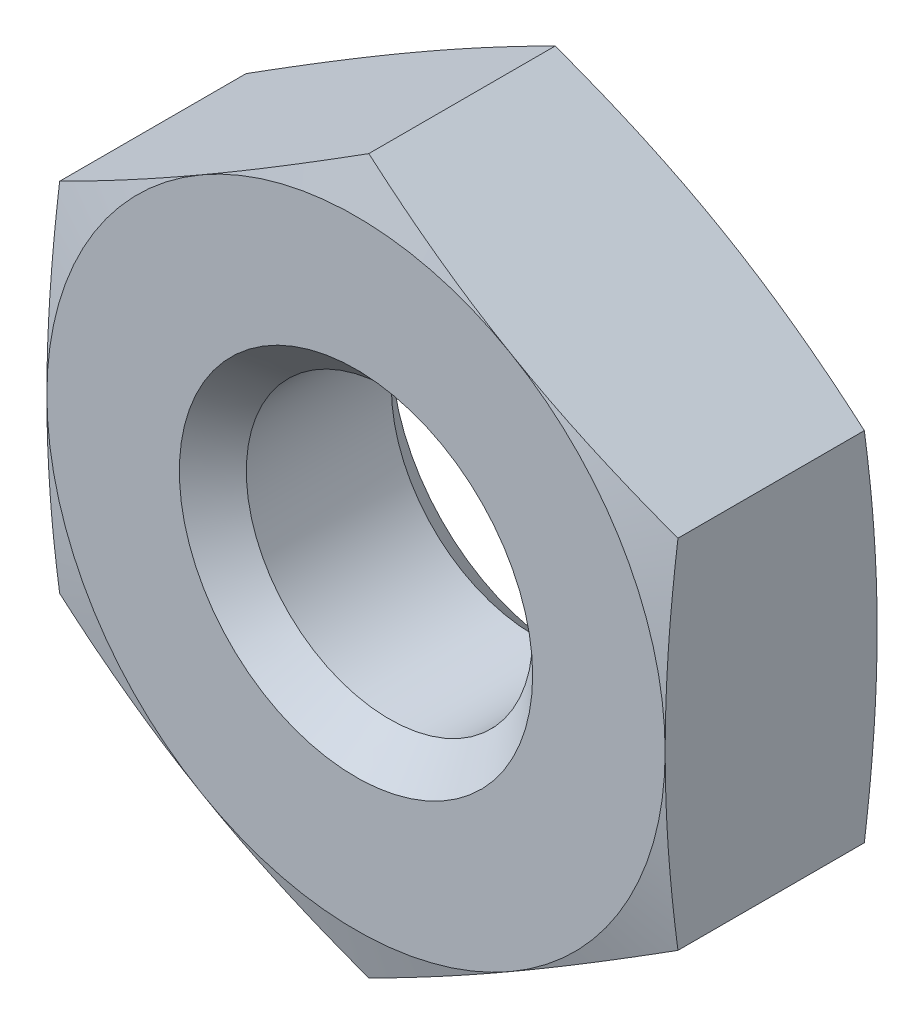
ISO-10303-21;
HEADER;
FILE_DESCRIPTION(('STEP AP214'),'2;1');
FILE_NAME('part.step','',(''),(''),'','','');
FILE_SCHEMA(('AUTOMOTIVE_DESIGN { 1 0 10303 214 1 1 1 1 }'));
ENDSEC;
DATA;
#1=APPLICATION_CONTEXT('core data for automotive mechanical design processes');
#2=APPLICATION_PROTOCOL_DEFINITION('international standard','automotive_design',2000,#1);
#3=PRODUCT_CONTEXT('',#1,'mechanical');
#4=PRODUCT('Part','Part','',(#3));
#5=PRODUCT_RELATED_PRODUCT_CATEGORY('part','',(#4));
#6=PRODUCT_DEFINITION_FORMATION('','',#4);
#7=PRODUCT_DEFINITION_CONTEXT('part definition',#1,'design');
#8=PRODUCT_DEFINITION('design','',#6,#7);
#9=PRODUCT_DEFINITION_SHAPE('','',#8);
#10=(LENGTH_UNIT() NAMED_UNIT(*) SI_UNIT(.MILLI.,.METRE.));
#11=(NAMED_UNIT(*) PLANE_ANGLE_UNIT() SI_UNIT($,.RADIAN.));
#12=(NAMED_UNIT(*) SI_UNIT($,.STERADIAN.) SOLID_ANGLE_UNIT());
#13=UNCERTAINTY_MEASURE_WITH_UNIT(LENGTH_MEASURE(1.E-05),#10,'distance_accuracy_value','');
#14=(GEOMETRIC_REPRESENTATION_CONTEXT(3) GLOBAL_UNCERTAINTY_ASSIGNED_CONTEXT((#13)) GLOBAL_UNIT_ASSIGNED_CONTEXT((#10,
#11,#12)) REPRESENTATION_CONTEXT('',''));
#15=CARTESIAN_POINT('',(0.,0.,0.));
#16=DIRECTION('',(0.,0.,1.));
#17=DIRECTION('',(1.,0.,0.));
#18=AXIS2_PLACEMENT_3D('',#15,#16,#17);
#19=CARTESIAN_POINT('',(0.,2.,-2.4));
#20=DIRECTION('',(0.,0.,1.));
#21=DIRECTION('',(1.,0.,0.));
#22=AXIS2_PLACEMENT_3D('',#19,#20,#21);
#23=PLANE('',#22);
#24=CARTESIAN_POINT('',(0.,0.,-2.40000000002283));
#25=DIRECTION('',(0.,0.,-1.));
#26=DIRECTION('',(-1.,0.,0.));
#27=AXIS2_PLACEMENT_3D('',#24,#25,#26);
#28=CIRCLE('',#27,1.99999999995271);
#29=CARTESIAN_POINT('',(-1.99999999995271,0.,-2.40000000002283));
#30=VERTEX_POINT('',#29);
#31=EDGE_CURVE('E20',#30,#30,#28,.F.);
#32=ORIENTED_EDGE('',*,*,#31,.T.);
#33=EDGE_LOOP('',(#32));
#34=FACE_BOUND('',#33,.T.);
#35=CARTESIAN_POINT('',(0.,0.,-2.39999999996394));
#36=DIRECTION('',(0.,0.,1.));
#37=DIRECTION('',(1.,0.,0.));
#38=AXIS2_PLACEMENT_3D('',#35,#36,#37);
#39=CIRCLE('',#38,3.50000000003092);
#40=CARTESIAN_POINT('',(1.75000000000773,-3.03108891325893,-2.39999999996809));
#41=VERTEX_POINT('',#40);
#42=CARTESIAN_POINT('',(3.50000000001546,0.,-2.39999999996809));
#43=VERTEX_POINT('',#42);
#44=EDGE_CURVE('E128',#41,#43,#39,.T.);
#45=ORIENTED_EDGE('',*,*,#44,.F.);
#46=CARTESIAN_POINT('',(0.,0.,-2.39999999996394));
#47=DIRECTION('',(0.,0.,1.));
#48=DIRECTION('',(1.,0.,0.));
#49=AXIS2_PLACEMENT_3D('',#46,#47,#48);
#50=CIRCLE('',#49,3.50000000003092);
#51=CARTESIAN_POINT('',(-1.75000000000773,-3.03108891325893,-2.39999999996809));
#52=VERTEX_POINT('',#51);
#53=EDGE_CURVE('E110',#52,#41,#50,.T.);
#54=ORIENTED_EDGE('',*,*,#53,.F.);
#55=CARTESIAN_POINT('',(0.,0.,-2.39999999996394));
#56=DIRECTION('',(0.,0.,1.));
#57=DIRECTION('',(1.,0.,0.));
#58=AXIS2_PLACEMENT_3D('',#55,#56,#57);
#59=CIRCLE('',#58,3.50000000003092);
#60=CARTESIAN_POINT('',(-3.50000000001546,0.,-2.39999999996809));
#61=VERTEX_POINT('',#60);
#62=EDGE_CURVE('E103',#61,#52,#59,.T.);
#63=ORIENTED_EDGE('',*,*,#62,.F.);
#64=CARTESIAN_POINT('',(0.,0.,-2.39999999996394));
#65=DIRECTION('',(0.,0.,1.));
#66=DIRECTION('',(1.,0.,0.));
#67=AXIS2_PLACEMENT_3D('',#64,#65,#66);
#68=CIRCLE('',#67,3.50000000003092);
#69=CARTESIAN_POINT('',(-1.75000000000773,3.03108891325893,-2.39999999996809));
#70=VERTEX_POINT('',#69);
#71=EDGE_CURVE('E425',#70,#61,#68,.T.);
#72=ORIENTED_EDGE('',*,*,#71,.F.);
#73=CARTESIAN_POINT('',(0.,0.,-2.39999999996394));
#74=DIRECTION('',(0.,0.,1.));
#75=DIRECTION('',(1.,0.,0.));
#76=AXIS2_PLACEMENT_3D('',#73,#74,#75);
#77=CIRCLE('',#76,3.50000000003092);
#78=CARTESIAN_POINT('',(1.75000000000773,3.03108891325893,-2.39999999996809));
#79=VERTEX_POINT('',#78);
#80=EDGE_CURVE('E135',#79,#70,#77,.T.);
#81=ORIENTED_EDGE('',*,*,#80,.F.);
#82=CARTESIAN_POINT('',(0.,0.,-2.39999999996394));
#83=DIRECTION('',(0.,0.,1.));
#84=DIRECTION('',(1.,0.,0.));
#85=AXIS2_PLACEMENT_3D('',#82,#83,#84);
#86=CIRCLE('',#85,3.50000000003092);
#87=EDGE_CURVE('E130',#43,#79,#86,.T.);
#88=ORIENTED_EDGE('',*,*,#87,.F.);
#89=EDGE_LOOP('',(#45,#54,#63,#72,#81,#88));
#90=FACE_BOUND('',#89,.T.);
#91=ADVANCED_FACE('F17',(#34,#90),#23,.F.);
#92=CARTESIAN_POINT('',(0.,0.,-2.39999999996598));
#93=DIRECTION('',(0.,0.,-1.));
#94=DIRECTION('',(-1.,0.,0.));
#95=AXIS2_PLACEMENT_3D('',#92,#93,#94);
#96=CONICAL_SURFACE('',#95,1.99999999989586,0.785398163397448);
#97=CARTESIAN_POINT('',(0.,0.,-2.021));
#98=DIRECTION('',(0.,0.,1.));
#99=DIRECTION('',(1.,0.,0.));
#100=AXIS2_PLACEMENT_3D('',#97,#98,#99);
#101=CIRCLE('',#100,1.621);
#102=CARTESIAN_POINT('',(1.621,0.,-2.021));
#103=VERTEX_POINT('',#102);
#104=EDGE_CURVE('E125',#103,#103,#101,.T.);
#105=ORIENTED_EDGE('',*,*,#104,.T.);
#106=EDGE_LOOP('',(#105));
#107=FACE_BOUND('',#106,.T.);
#108=ORIENTED_EDGE('',*,*,#31,.F.);
#109=EDGE_LOOP('',(#108));
#110=FACE_BOUND('',#109,.T.);
#111=ADVANCED_FACE('F307',(#107,#110),#96,.F.);
#112=CARTESIAN_POINT('',(0.,0.,-2.25404791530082));
#113=DIRECTION('',(0.,0.,1.));
#114=DIRECTION('',(1.,0.,0.));
#115=AXIS2_PLACEMENT_3D('',#112,#113,#114);
#116=CONICAL_SURFACE('',#115,4.04470059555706,1.30899693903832);
#117=CARTESIAN_POINT('',(-1.75,-3.03108891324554,-2.39999999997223));
#118=CARTESIAN_POINT('',(-1.67678656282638,-3.07335871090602,-2.40000384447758));
#119=CARTESIAN_POINT('',(-1.60357518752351,-3.11562731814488,-2.39917891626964));
#120=CARTESIAN_POINT('',(-1.45718196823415,-3.20014748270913,-2.39590404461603));
#121=CARTESIAN_POINT('',(-1.38400012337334,-3.24239904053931,-2.39345415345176));
#122=CARTESIAN_POINT('',(-1.16470054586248,-3.36901171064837,-2.38372331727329));
#123=CARTESIAN_POINT('',(-1.0186579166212,-3.45332946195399,-2.37406106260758));
#124=CARTESIAN_POINT('',(-0.726992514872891,-3.62172256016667,-2.34897707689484));
#125=CARTESIAN_POINT('',(-0.581369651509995,-3.70579795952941,-2.33355670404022));
#126=CARTESIAN_POINT('',(-0.290410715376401,-3.87378317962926,-2.29775556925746));
#127=CARTESIAN_POINT('',(-0.145075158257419,-3.95769270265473,-2.27736917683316));
#128=CARTESIAN_POINT('',(-3.5042136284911E-13,-4.04145188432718,-2.25491840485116));
#129=B_SPLINE_CURVE_WITH_KNOTS('',3,(#117,#118,#119,#120,#121,#122,#123,#124,#125,#126,#127,
#128),.UNSPECIFIED.,.F.,.F.,(4,2,2,2,2,4),(0.,0.253610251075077,0.507212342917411,
1.01382506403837,1.52031836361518,2.02738862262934),.UNSPECIFIED.);
#130=CARTESIAN_POINT('',(0.,-4.04145188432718,-2.25491840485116));
#131=VERTEX_POINT('',#130);
#132=EDGE_CURVE('E115',#52,#131,#129,.T.);
#133=ORIENTED_EDGE('',*,*,#132,.F.);
#134=ORIENTED_EDGE('',*,*,#53,.T.);
#135=CARTESIAN_POINT('',(3.49830599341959E-13,-4.04145188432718,-2.25491840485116));
#136=CARTESIAN_POINT('',(0.145075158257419,-3.95769270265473,-2.27736917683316));
#137=CARTESIAN_POINT('',(0.290410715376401,-3.87378317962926,-2.29775556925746));
#138=CARTESIAN_POINT('',(0.581369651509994,-3.70579795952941,-2.33355670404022));
#139=CARTESIAN_POINT('',(0.726992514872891,-3.62172256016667,-2.34897707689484));
#140=CARTESIAN_POINT('',(1.0186579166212,-3.45332946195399,-2.37406106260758));
#141=CARTESIAN_POINT('',(1.16470054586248,-3.36901171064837,-2.38372331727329));
#142=CARTESIAN_POINT('',(1.38400012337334,-3.24239904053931,-2.39345415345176));
#143=CARTESIAN_POINT('',(1.45718196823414,-3.20014748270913,-2.39590404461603));
#144=CARTESIAN_POINT('',(1.60357518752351,-3.11562731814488,-2.39917891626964));
#145=CARTESIAN_POINT('',(1.67678656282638,-3.07335871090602,-2.40000384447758));
#146=CARTESIAN_POINT('',(1.75,-3.03108891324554,-2.39999999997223));
#147=B_SPLINE_CURVE_WITH_KNOTS('',3,(#135,#136,#137,#138,#139,#140,#141,#142,#143,#144,#145,
#146),.UNSPECIFIED.,.F.,.F.,(4,2,2,2,2,4),(0.,0.507070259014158,1.01356355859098,
1.52017627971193,1.77377837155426,2.02738862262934),.UNSPECIFIED.);
#148=EDGE_CURVE('E113',#131,#41,#147,.T.);
#149=ORIENTED_EDGE('',*,*,#148,.F.);
#150=EDGE_LOOP('',(#133,#134,#149));
#151=FACE_BOUND('',#150,.T.);
#152=ADVANCED_FACE('F112',(#151),#116,.T.);
#153=CARTESIAN_POINT('',(0.,0.,-2.25404791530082));
#154=DIRECTION('',(0.,0.,1.));
#155=DIRECTION('',(1.,0.,0.));
#156=AXIS2_PLACEMENT_3D('',#153,#154,#155);
#157=CONICAL_SURFACE('',#156,4.04470059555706,1.30899693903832);
#158=CARTESIAN_POINT('',(-3.5,0.,-2.39999999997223));
#159=CARTESIAN_POINT('',(-3.5,-0.0845395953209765,-2.40000384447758));
#160=CARTESIAN_POINT('',(-3.5,-0.169076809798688,-2.39917891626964));
#161=CARTESIAN_POINT('',(-3.5,-0.338117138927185,-2.39590404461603));
#162=CARTESIAN_POINT('',(-3.5,-0.422620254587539,-2.39345415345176));
#163=CARTESIAN_POINT('',(-3.5,-0.675845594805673,-2.38372331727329));
#164=CARTESIAN_POINT('',(-3.5,-0.8444810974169,-2.37406106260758));
#165=CARTESIAN_POINT('',(-3.5,-1.18126729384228,-2.34897707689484));
#166=CARTESIAN_POINT('',(-3.5,-1.34941809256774,-2.33355670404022));
#167=CARTESIAN_POINT('',(-3.5,-1.68538853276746,-2.29775556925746));
#168=CARTESIAN_POINT('',(-3.5,-1.85320757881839,-2.27736917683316));
#169=CARTESIAN_POINT('',(-3.5,-2.02072594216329,-2.25491840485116));
#170=B_SPLINE_CURVE_WITH_KNOTS('',3,(#158,#159,#160,#161,#162,#163,#164,#165,#166,#167,#168,
#169),.UNSPECIFIED.,.F.,.F.,(4,2,2,2,2,4),(0.,0.253610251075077,0.507212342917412,
1.01382506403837,1.52031836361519,2.02738862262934),.UNSPECIFIED.);
#171=CARTESIAN_POINT('',(-3.49999999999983,-2.02072594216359,-2.25491840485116));
#172=VERTEX_POINT('',#171);
#173=EDGE_CURVE('E296',#61,#172,#170,.T.);
#174=ORIENTED_EDGE('',*,*,#173,.F.);
#175=ORIENTED_EDGE('',*,*,#62,.T.);
#176=CARTESIAN_POINT('',(-3.49999999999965,-2.02072594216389,-2.25491840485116));
#177=CARTESIAN_POINT('',(-3.35492484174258,-2.10448512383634,-2.27736917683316));
#178=CARTESIAN_POINT('',(-3.2095892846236,-2.18839464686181,-2.29775556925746));
#179=CARTESIAN_POINT('',(-2.91863034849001,-2.35637986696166,-2.33355670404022));
#180=CARTESIAN_POINT('',(-2.77300748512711,-2.4404552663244,-2.34897707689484));
#181=CARTESIAN_POINT('',(-2.4813420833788,-2.60884836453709,-2.37406106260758));
#182=CARTESIAN_POINT('',(-2.33529945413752,-2.6931661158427,-2.38372331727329));
#183=CARTESIAN_POINT('',(-2.11599987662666,-2.81977878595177,-2.39345415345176));
#184=CARTESIAN_POINT('',(-2.04281803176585,-2.86203034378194,-2.39590404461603));
#185=CARTESIAN_POINT('',(-1.89642481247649,-2.94655050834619,-2.39917891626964));
#186=CARTESIAN_POINT('',(-1.82321343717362,-2.98881911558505,-2.40000384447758));
#187=CARTESIAN_POINT('',(-1.75,-3.03108891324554,-2.39999999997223));
#188=B_SPLINE_CURVE_WITH_KNOTS('',3,(#176,#177,#178,#179,#180,#181,#182,#183,#184,#185,#186,
#187),.UNSPECIFIED.,.F.,.F.,(4,2,2,2,2,4),(0.,0.507070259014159,1.01356355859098,
1.52017627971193,1.77377837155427,2.02738862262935),.UNSPECIFIED.);
#189=EDGE_CURVE('E139',#172,#52,#188,.T.);
#190=ORIENTED_EDGE('',*,*,#189,.F.);
#191=EDGE_LOOP('',(#174,#175,#190));
#192=FACE_BOUND('',#191,.T.);
#193=ADVANCED_FACE('F286',(#192),#157,.T.);
#194=CARTESIAN_POINT('',(0.,0.,-2.25404791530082));
#195=DIRECTION('',(0.,0.,1.));
#196=DIRECTION('',(1.,0.,0.));
#197=AXIS2_PLACEMENT_3D('',#194,#195,#196);
#198=CONICAL_SURFACE('',#197,4.04470059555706,1.30899693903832);
#199=ORIENTED_EDGE('',*,*,#71,.T.);
#200=CARTESIAN_POINT('',(-3.5,2.02072594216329,-2.25491840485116));
#201=CARTESIAN_POINT('',(-3.5,1.85320757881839,-2.27736917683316));
#202=CARTESIAN_POINT('',(-3.5,1.68538853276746,-2.29775556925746));
#203=CARTESIAN_POINT('',(-3.5,1.34941809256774,-2.33355670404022));
#204=CARTESIAN_POINT('',(-3.5,1.18126729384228,-2.34897707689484));
#205=CARTESIAN_POINT('',(-3.5,0.844481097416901,-2.37406106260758));
#206=CARTESIAN_POINT('',(-3.5,0.675845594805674,-2.38372331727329));
#207=CARTESIAN_POINT('',(-3.5,0.42262025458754,-2.39345415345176));
#208=CARTESIAN_POINT('',(-3.5,0.338117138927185,-2.39590404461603));
#209=CARTESIAN_POINT('',(-3.5,0.169076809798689,-2.39917891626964));
#210=CARTESIAN_POINT('',(-3.5,0.0845395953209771,-2.40000384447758));
#211=CARTESIAN_POINT('',(-3.5,0.,-2.39999999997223));
#212=B_SPLINE_CURVE_WITH_KNOTS('',3,(#200,#201,#202,#203,#204,#205,#206,#207,#208,#209,#210,
#211),.UNSPECIFIED.,.F.,.F.,(4,2,2,2,2,4),(0.,0.507070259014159,1.01356355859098,
1.52017627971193,1.77377837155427,2.02738862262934),.UNSPECIFIED.);
#213=CARTESIAN_POINT('',(-3.49999999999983,2.02072594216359,-2.25491840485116));
#214=VERTEX_POINT('',#213);
#215=EDGE_CURVE('E291',#214,#61,#212,.T.);
#216=ORIENTED_EDGE('',*,*,#215,.F.);
#217=CARTESIAN_POINT('',(-1.75,3.03108891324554,-2.39999999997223));
#218=CARTESIAN_POINT('',(-1.82321343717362,2.98881911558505,-2.40000384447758));
#219=CARTESIAN_POINT('',(-1.89642481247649,2.94655050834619,-2.39917891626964));
#220=CARTESIAN_POINT('',(-2.04281803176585,2.86203034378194,-2.39590404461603));
#221=CARTESIAN_POINT('',(-2.11599987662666,2.81977878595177,-2.39345415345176));
#222=CARTESIAN_POINT('',(-2.33529945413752,2.6931661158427,-2.38372331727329));
#223=CARTESIAN_POINT('',(-2.4813420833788,2.60884836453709,-2.37406106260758));
#224=CARTESIAN_POINT('',(-2.77300748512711,2.4404552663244,-2.34897707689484));
#225=CARTESIAN_POINT('',(-2.91863034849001,2.35637986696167,-2.33355670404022));
#226=CARTESIAN_POINT('',(-3.2095892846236,2.18839464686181,-2.29775556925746));
#227=CARTESIAN_POINT('',(-3.35492484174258,2.10448512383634,-2.27736917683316));
#228=CARTESIAN_POINT('',(-3.49999999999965,2.02072594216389,-2.25491840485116));
#229=B_SPLINE_CURVE_WITH_KNOTS('',3,(#217,#218,#219,#220,#221,#222,#223,#224,#225,#226,#227,
#228),.UNSPECIFIED.,.F.,.F.,(4,2,2,2,2,4),(0.,0.253610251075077,0.507212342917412,
1.01382506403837,1.52031836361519,2.02738862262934),.UNSPECIFIED.);
#230=EDGE_CURVE('E269',#70,#214,#229,.T.);
#231=ORIENTED_EDGE('',*,*,#230,.F.);
#232=EDGE_LOOP('',(#199,#216,#231));
#233=FACE_BOUND('',#232,.T.);
#234=ADVANCED_FACE('F283',(#233),#198,.T.);
#235=CARTESIAN_POINT('',(0.,0.,-2.25404791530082));
#236=DIRECTION('',(0.,0.,1.));
#237=DIRECTION('',(1.,0.,0.));
#238=AXIS2_PLACEMENT_3D('',#235,#236,#237);
#239=CONICAL_SURFACE('',#238,4.04470059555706,1.30899693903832);
#240=ORIENTED_EDGE('',*,*,#80,.T.);
#241=CARTESIAN_POINT('',(-3.49976461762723E-13,4.04145188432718,-2.25491840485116));
#242=CARTESIAN_POINT('',(-0.145075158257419,3.95769270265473,-2.27736917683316));
#243=CARTESIAN_POINT('',(-0.290410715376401,3.87378317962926,-2.29775556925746));
#244=CARTESIAN_POINT('',(-0.581369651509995,3.70579795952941,-2.33355670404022));
#245=CARTESIAN_POINT('',(-0.726992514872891,3.62172256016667,-2.34897707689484));
#246=CARTESIAN_POINT('',(-1.0186579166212,3.45332946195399,-2.37406106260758));
#247=CARTESIAN_POINT('',(-1.16470054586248,3.36901171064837,-2.38372331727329));
#248=CARTESIAN_POINT('',(-1.38400012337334,3.24239904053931,-2.39345415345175));
#249=CARTESIAN_POINT('',(-1.45718196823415,3.20014748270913,-2.39590404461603));
#250=CARTESIAN_POINT('',(-1.60357518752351,3.11562731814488,-2.39917891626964));
#251=CARTESIAN_POINT('',(-1.67678656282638,3.07335871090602,-2.40000384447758));
#252=CARTESIAN_POINT('',(-1.75,3.03108891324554,-2.39999999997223));
#253=B_SPLINE_CURVE_WITH_KNOTS('',3,(#241,#242,#243,#244,#245,#246,#247,#248,#249,#250,#251,
#252),.UNSPECIFIED.,.F.,.F.,(4,2,2,2,2,4),(0.,0.507070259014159,1.01356355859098,
1.52017627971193,1.77377837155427,2.02738862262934),.UNSPECIFIED.);
#254=CARTESIAN_POINT('',(0.,4.04145188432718,-2.25491840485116));
#255=VERTEX_POINT('',#254);
#256=EDGE_CURVE('E274',#255,#70,#253,.T.);
#257=ORIENTED_EDGE('',*,*,#256,.F.);
#258=CARTESIAN_POINT('',(1.75,3.03108891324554,-2.39999999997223));
#259=CARTESIAN_POINT('',(1.67678656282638,3.07335871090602,-2.40000384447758));
#260=CARTESIAN_POINT('',(1.60357518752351,3.11562731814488,-2.39917891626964));
#261=CARTESIAN_POINT('',(1.45718196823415,3.20014748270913,-2.39590404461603));
#262=CARTESIAN_POINT('',(1.38400012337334,3.24239904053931,-2.39345415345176));
#263=CARTESIAN_POINT('',(1.16470054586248,3.36901171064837,-2.38372331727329));
#264=CARTESIAN_POINT('',(1.0186579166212,3.45332946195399,-2.37406106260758));
#265=CARTESIAN_POINT('',(0.726992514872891,3.62172256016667,-2.34897707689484));
#266=CARTESIAN_POINT('',(0.581369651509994,3.70579795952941,-2.33355670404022));
#267=CARTESIAN_POINT('',(0.290410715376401,3.87378317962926,-2.29775556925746));
#268=CARTESIAN_POINT('',(0.145075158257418,3.95769270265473,-2.27736917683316));
#269=CARTESIAN_POINT('',(3.49543170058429E-13,4.04145188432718,-2.25491840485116));
#270=B_SPLINE_CURVE_WITH_KNOTS('',3,(#258,#259,#260,#261,#262,#263,#264,#265,#266,#267,#268,
#269),.UNSPECIFIED.,.F.,.F.,(4,2,2,2,2,4),(0.,0.253610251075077,0.507212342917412,
1.01382506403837,1.52031836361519,2.02738862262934),.UNSPECIFIED.);
#271=EDGE_CURVE('E183',#79,#255,#270,.T.);
#272=ORIENTED_EDGE('',*,*,#271,.F.);
#273=EDGE_LOOP('',(#240,#257,#272));
#274=FACE_BOUND('',#273,.T.);
#275=ADVANCED_FACE('F165',(#274),#239,.T.);
#276=CARTESIAN_POINT('',(0.,0.,-2.25404791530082));
#277=DIRECTION('',(0.,0.,1.));
#278=DIRECTION('',(1.,0.,0.));
#279=AXIS2_PLACEMENT_3D('',#276,#277,#278);
#280=CONICAL_SURFACE('',#279,4.04470059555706,1.30899693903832);
#281=CARTESIAN_POINT('',(1.75,-3.03108891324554,-2.39999999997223));
#282=CARTESIAN_POINT('',(1.82321343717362,-2.98881911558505,-2.40000384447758));
#283=CARTESIAN_POINT('',(1.89642481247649,-2.94655050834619,-2.39917891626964));
#284=CARTESIAN_POINT('',(2.04281803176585,-2.86203034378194,-2.39590404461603));
#285=CARTESIAN_POINT('',(2.11599987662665,-2.81977878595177,-2.39345415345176));
#286=CARTESIAN_POINT('',(2.33529945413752,-2.6931661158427,-2.38372331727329));
#287=CARTESIAN_POINT('',(2.4813420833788,-2.60884836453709,-2.37406106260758));
#288=CARTESIAN_POINT('',(2.77300748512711,-2.4404552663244,-2.34897707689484));
#289=CARTESIAN_POINT('',(2.91863034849,-2.35637986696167,-2.33355670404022));
#290=CARTESIAN_POINT('',(3.2095892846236,-2.18839464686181,-2.29775556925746));
#291=CARTESIAN_POINT('',(3.35492484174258,-2.10448512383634,-2.27736917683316));
#292=CARTESIAN_POINT('',(3.49999999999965,-2.02072594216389,-2.25491840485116));
#293=B_SPLINE_CURVE_WITH_KNOTS('',3,(#281,#282,#283,#284,#285,#286,#287,#288,#289,#290,#291,
#292),.UNSPECIFIED.,.F.,.F.,(4,2,2,2,2,4),(0.,0.253610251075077,0.507212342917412,
1.01382506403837,1.52031836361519,2.02738862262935),.UNSPECIFIED.);
#294=CARTESIAN_POINT('',(3.49999999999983,-2.02072594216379,-2.25491840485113));
#295=VERTEX_POINT('',#294);
#296=EDGE_CURVE('E121',#41,#295,#293,.T.);
#297=ORIENTED_EDGE('',*,*,#296,.F.);
#298=ORIENTED_EDGE('',*,*,#44,.T.);
#299=CARTESIAN_POINT('',(3.5,-2.02072594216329,-2.25491840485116));
#300=CARTESIAN_POINT('',(3.5,-1.8532075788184,-2.27736917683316));
#301=CARTESIAN_POINT('',(3.5,-1.68538853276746,-2.29775556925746));
#302=CARTESIAN_POINT('',(3.5,-1.34941809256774,-2.33355670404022));
#303=CARTESIAN_POINT('',(3.5,-1.18126729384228,-2.34897707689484));
#304=CARTESIAN_POINT('',(3.5,-0.844481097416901,-2.37406106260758));
#305=CARTESIAN_POINT('',(3.5,-0.675845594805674,-2.38372331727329));
#306=CARTESIAN_POINT('',(3.5,-0.42262025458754,-2.39345415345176));
#307=CARTESIAN_POINT('',(3.5,-0.338117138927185,-2.39590404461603));
#308=CARTESIAN_POINT('',(3.5,-0.169076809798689,-2.39917891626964));
#309=CARTESIAN_POINT('',(3.5,-0.084539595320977,-2.40000384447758));
#310=CARTESIAN_POINT('',(3.5,0.,-2.39999999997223));
#311=B_SPLINE_CURVE_WITH_KNOTS('',3,(#299,#300,#301,#302,#303,#304,#305,#306,#307,#308,#309,
#310),.UNSPECIFIED.,.F.,.F.,(4,2,2,2,2,4),(0.,0.507070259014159,1.01356355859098,
1.52017627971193,1.77377837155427,2.02738862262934),.UNSPECIFIED.);
#312=EDGE_CURVE('E138',#295,#43,#311,.T.);
#313=ORIENTED_EDGE('',*,*,#312,.F.);
#314=EDGE_LOOP('',(#297,#298,#313));
#315=FACE_BOUND('',#314,.T.);
#316=ADVANCED_FACE('F137',(#315),#280,.T.);
#317=CARTESIAN_POINT('',(0.,0.,-2.25404791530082));
#318=DIRECTION('',(0.,0.,1.));
#319=DIRECTION('',(1.,0.,0.));
#320=AXIS2_PLACEMENT_3D('',#317,#318,#319);
#321=CONICAL_SURFACE('',#320,4.04470059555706,1.30899693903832);
#322=ORIENTED_EDGE('',*,*,#87,.T.);
#323=CARTESIAN_POINT('',(3.49999999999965,2.02072594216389,-2.25491840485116));
#324=CARTESIAN_POINT('',(3.35492484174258,2.10448512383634,-2.27736917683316));
#325=CARTESIAN_POINT('',(3.2095892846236,2.18839464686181,-2.29775556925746));
#326=CARTESIAN_POINT('',(2.91863034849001,2.35637986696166,-2.33355670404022));
#327=CARTESIAN_POINT('',(2.77300748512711,2.4404552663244,-2.34897707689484));
#328=CARTESIAN_POINT('',(2.4813420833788,2.60884836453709,-2.37406106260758));
#329=CARTESIAN_POINT('',(2.33529945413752,2.6931661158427,-2.38372331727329));
#330=CARTESIAN_POINT('',(2.11599987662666,2.81977878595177,-2.39345415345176));
#331=CARTESIAN_POINT('',(2.04281803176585,2.86203034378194,-2.39590404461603));
#332=CARTESIAN_POINT('',(1.89642481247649,2.94655050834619,-2.39917891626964));
#333=CARTESIAN_POINT('',(1.82321343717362,2.98881911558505,-2.40000384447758));
#334=CARTESIAN_POINT('',(1.75,3.03108891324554,-2.39999999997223));
#335=B_SPLINE_CURVE_WITH_KNOTS('',3,(#323,#324,#325,#326,#327,#328,#329,#330,#331,#332,#333,
#334),.UNSPECIFIED.,.F.,.F.,(4,2,2,2,2,4),(0.,0.507070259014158,1.01356355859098,
1.52017627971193,1.77377837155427,2.02738862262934),.UNSPECIFIED.);
#336=CARTESIAN_POINT('',(3.49999999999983,2.02072594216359,-2.25491840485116));
#337=VERTEX_POINT('',#336);
#338=EDGE_CURVE('E275',#337,#79,#335,.T.);
#339=ORIENTED_EDGE('',*,*,#338,.F.);
#340=CARTESIAN_POINT('',(3.5,0.,-2.39999999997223));
#341=CARTESIAN_POINT('',(3.5,0.0845395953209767,-2.40000384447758));
#342=CARTESIAN_POINT('',(3.5,0.169076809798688,-2.39917891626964));
#343=CARTESIAN_POINT('',(3.5,0.338117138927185,-2.39590404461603));
#344=CARTESIAN_POINT('',(3.5,0.42262025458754,-2.39345415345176));
#345=CARTESIAN_POINT('',(3.5,0.675845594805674,-2.38372331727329));
#346=CARTESIAN_POINT('',(3.5,0.844481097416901,-2.37406106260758));
#347=CARTESIAN_POINT('',(3.5,1.18126729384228,-2.34897707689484));
#348=CARTESIAN_POINT('',(3.5,1.34941809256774,-2.33355670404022));
#349=CARTESIAN_POINT('',(3.5,1.68538853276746,-2.29775556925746));
#350=CARTESIAN_POINT('',(3.5,1.85320757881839,-2.27736917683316));
#351=CARTESIAN_POINT('',(3.5,2.02072594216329,-2.25491840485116));
#352=B_SPLINE_CURVE_WITH_KNOTS('',3,(#340,#341,#342,#343,#344,#345,#346,#347,#348,#349,#350,
#351),.UNSPECIFIED.,.F.,.F.,(4,2,2,2,2,4),(0.,0.253610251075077,0.507212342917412,
1.01382506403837,1.52031836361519,2.02738862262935),.UNSPECIFIED.);
#353=EDGE_CURVE('E177',#43,#337,#352,.T.);
#354=ORIENTED_EDGE('',*,*,#353,.F.);
#355=EDGE_LOOP('',(#322,#339,#354));
#356=FACE_BOUND('',#355,.T.);
#357=ADVANCED_FACE('F164',(#356),#321,.T.);
#358=CARTESIAN_POINT('',(0.,0.,-2.4));
#359=DIRECTION('',(0.,0.,1.));
#360=DIRECTION('',(1.,0.,0.));
#361=AXIS2_PLACEMENT_3D('',#358,#359,#360);
#362=CYLINDRICAL_SURFACE('',#361,1.621);
#363=ORIENTED_EDGE('',*,*,#104,.F.);
#364=EDGE_LOOP('',(#363));
#365=FACE_BOUND('',#364,.T.);
#366=CARTESIAN_POINT('',(0.,0.,-0.379000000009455));
#367=DIRECTION('',(0.,0.,1.));
#368=DIRECTION('',(1.,0.,0.));
#369=AXIS2_PLACEMENT_3D('',#366,#367,#368);
#370=CIRCLE('',#369,1.62100000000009);
#371=CARTESIAN_POINT('',(1.62100000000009,0.,-0.379000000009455));
#372=VERTEX_POINT('',#371);
#373=EDGE_CURVE('E347',#372,#372,#370,.T.);
#374=ORIENTED_EDGE('',*,*,#373,.T.);
#375=EDGE_LOOP('',(#374));
#376=FACE_BOUND('',#375,.T.);
#377=ADVANCED_FACE('F450',(#365,#376),#362,.F.);
#378=CARTESIAN_POINT('',(0.,-4.04145188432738,-3.4));
#379=DIRECTION('',(0.5,-0.866025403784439,0.));
#380=DIRECTION('',(0.866025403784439,0.5,0.));
#381=AXIS2_PLACEMENT_3D('',#378,#379,#380);
#382=PLANE('',#381);
#383=ORIENTED_EDGE('',*,*,#296,.T.);
#384=DIRECTION('',(0.,0.,-1.));
#385=VECTOR('',#384,1.);
#386=CARTESIAN_POINT('',(3.5,-2.02072594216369,-3.4));
#387=LINE('',#386,#385);
#388=CARTESIAN_POINT('',(3.50000001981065,-2.02072593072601,-0.14508159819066));
#389=VERTEX_POINT('',#388);
#390=EDGE_CURVE('E178',#389,#295,#387,.T.);
#391=ORIENTED_EDGE('',*,*,#390,.F.);
#392=CARTESIAN_POINT('',(1.75000000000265,-3.03108891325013,1.43933011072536E-11));
#393=CARTESIAN_POINT('',(1.8232134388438,-2.98881911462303,3.84451752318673E-06));
#394=CARTESIAN_POINT('',(1.89642481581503,-2.94655050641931,-0.000821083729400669));
#395=CARTESIAN_POINT('',(2.0428180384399,-2.86203033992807,-0.00409595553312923));
#396=CARTESIAN_POINT('',(2.11599988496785,-2.81977878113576,-0.00654584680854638));
#397=CARTESIAN_POINT('',(2.33529946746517,-2.69316610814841,-0.0162766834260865));
#398=CARTESIAN_POINT('',(2.48134210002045,-2.60884835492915,-0.0259389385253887));
#399=CARTESIAN_POINT('',(2.77300750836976,-2.44045525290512,-0.0510229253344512));
#400=CARTESIAN_POINT('',(2.91863037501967,-2.35637985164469,-0.0664432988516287));
#401=CARTESIAN_POINT('',(3.20958931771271,-2.18839462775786,-0.102244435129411));
#402=CARTESIAN_POINT('',(3.35492487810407,-2.10448510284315,-0.122630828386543));
#403=CARTESIAN_POINT('',(3.5000000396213,-2.02072591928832,-0.145081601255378));
#404=B_SPLINE_CURVE_WITH_KNOTS('',3,(#392,#393,#394,#395,#396,#397,#398,#399,#400,#401,#402,
#403),.UNSPECIFIED.,.F.,.F.,(4,2,2,2,2,4),(0.,0.253610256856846,0.507212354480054,
1.01382508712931,1.52031839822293,2.02738866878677),.UNSPECIFIED.);
#405=CARTESIAN_POINT('',(1.75000000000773,-3.03108891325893,6.1834054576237E-12));
#406=VERTEX_POINT('',#405);
#407=EDGE_CURVE('E409',#406,#389,#404,.T.);
#408=ORIENTED_EDGE('',*,*,#407,.F.);
#409=CARTESIAN_POINT('',(8.3690819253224E-08,-4.04145183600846,-0.145081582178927));
#410=CARTESIAN_POINT('',(0.145075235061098,-3.95769265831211,-0.122630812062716));
#411=CARTESIAN_POINT('',(0.290410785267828,-3.87378313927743,-0.102244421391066));
#412=CARTESIAN_POINT('',(0.581369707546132,-3.70579792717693,-0.0664432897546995));
#413=CARTESIAN_POINT('',(0.726992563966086,-3.62172253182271,-0.0510229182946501));
#414=CARTESIAN_POINT('',(1.01865795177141,-3.45332944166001,-0.0259389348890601));
#415=CARTESIAN_POINT('',(1.16470057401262,-3.36901169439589,-0.0162766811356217));
#416=CARTESIAN_POINT('',(1.38400014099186,-3.24239903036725,-0.00654584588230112));
#417=CARTESIAN_POINT('',(1.45718198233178,-3.20014747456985,-0.00409595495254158));
#418=CARTESIAN_POINT('',(1.60357519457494,-3.11562731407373,-0.000821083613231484));
#419=CARTESIAN_POINT('',(1.67678656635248,-3.07335870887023,3.84451495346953E-06));
#420=CARTESIAN_POINT('',(1.75000000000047,-3.03108891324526,1.03260536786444E-11));
#421=B_SPLINE_CURVE_WITH_KNOTS('',3,(#409,#410,#411,#412,#413,#414,#415,#416,#417,#418,#419,
#420),.UNSPECIFIED.,.F.,.F.,(4,2,2,2,2,4),(0.,0.507070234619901,1.01356350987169,
1.52017620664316,1.77377828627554,2.02738852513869),.UNSPECIFIED.);
#422=CARTESIAN_POINT('',(1.98121612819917E-08,-4.04145189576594,-0.145081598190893));
#423=VERTEX_POINT('',#422);
#424=EDGE_CURVE('E405',#423,#406,#421,.T.);
#425=ORIENTED_EDGE('',*,*,#424,.F.);
#426=DIRECTION('',(0.,0.,1.));
#427=VECTOR('',#426,1.);
#428=CARTESIAN_POINT('',(0.,-4.04145188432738,-3.4));
#429=LINE('',#428,#427);
#430=EDGE_CURVE('E124',#131,#423,#429,.T.);
#431=ORIENTED_EDGE('',*,*,#430,.F.);
#432=ORIENTED_EDGE('',*,*,#148,.T.);
#433=EDGE_LOOP('',(#383,#391,#408,#425,#431,#432));
#434=FACE_BOUND('',#433,.T.);
#435=ADVANCED_FACE('F119',(#434),#382,.T.);
#436=CARTESIAN_POINT('',(-3.5,-2.02072594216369,-3.4));
#437=DIRECTION('',(-0.5,-0.866025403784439,0.));
#438=DIRECTION('',(0.866025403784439,-0.5,0.));
#439=AXIS2_PLACEMENT_3D('',#436,#437,#438);
#440=PLANE('',#439);
#441=ORIENTED_EDGE('',*,*,#132,.T.);
#442=ORIENTED_EDGE('',*,*,#430,.T.);
#443=CARTESIAN_POINT('',(-1.75000000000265,-3.03108891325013,1.43936354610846E-11));
#444=CARTESIAN_POINT('',(-1.67678656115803,-3.0733587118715,3.84451752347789E-06));
#445=CARTESIAN_POINT('',(-1.60357518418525,-3.11562732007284,-0.000821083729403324));
#446=CARTESIAN_POINT('',(-1.45718196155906,-3.20014748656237,-0.00409595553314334));
#447=CARTESIAN_POINT('',(-1.38400011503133,-3.24239904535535,-0.00654584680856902));
#448=CARTESIAN_POINT('',(-1.16470053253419,-3.3690117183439,-0.0162766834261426));
#449=CARTESIAN_POINT('',(-1.01865789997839,-3.45332947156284,-0.0259389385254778));
#450=CARTESIAN_POINT('',(-0.726992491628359,-3.62172257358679,-0.0510229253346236));
#451=CARTESIAN_POINT('',(-0.58136962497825,-3.70579797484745,-0.0664432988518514));
#452=CARTESIAN_POINT('',(-0.290410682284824,-3.87378319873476,-0.102244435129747));
#453=CARTESIAN_POINT('',(-0.145075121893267,-3.95769272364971,-0.122630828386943));
#454=CARTESIAN_POINT('',(3.96243222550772E-08,-4.04145190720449,-0.145081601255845));
#455=B_SPLINE_CURVE_WITH_KNOTS('',3,(#443,#444,#445,#446,#447,#448,#449,#450,#451,#452,#453,
#454),.UNSPECIFIED.,.F.,.F.,(4,2,2,2,2,4),(0.,0.253610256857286,0.507212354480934,
1.01382508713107,1.52031839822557,2.02738866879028),.UNSPECIFIED.);
#456=CARTESIAN_POINT('',(-1.75000000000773,-3.03108891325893,6.18337024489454E-12));
#457=VERTEX_POINT('',#456);
#458=EDGE_CURVE('E380',#457,#423,#455,.T.);
#459=ORIENTED_EDGE('',*,*,#458,.F.);
#460=CARTESIAN_POINT('',(-3.49999991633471,-2.02072599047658,-0.145081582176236));
#461=CARTESIAN_POINT('',(-3.3549247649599,-2.10448516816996,-0.122630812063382));
#462=CARTESIAN_POINT('',(-3.2095892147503,-2.18839468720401,-0.102244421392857));
#463=CARTESIAN_POINT('',(-2.9186302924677,-2.35637989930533,-0.0664432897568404));
#464=CARTESIAN_POINT('',(-2.77300743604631,-2.44045529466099,-0.0510229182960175));
#465=CARTESIAN_POINT('',(-2.48134204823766,-2.60884838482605,-0.0259389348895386));
#466=CARTESIAN_POINT('',(-2.33529942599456,-2.69316613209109,-0.0162766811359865));
#467=CARTESIAN_POINT('',(-2.11599985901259,-2.81977879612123,-0.00654584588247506));
#468=CARTESIAN_POINT('',(-2.04281801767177,-2.86203035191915,-0.00409595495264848));
#469=CARTESIAN_POINT('',(-1.89642480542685,-2.94655051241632,-0.000821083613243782));
#470=CARTESIAN_POINT('',(-1.82321343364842,-2.98881911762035,3.84451496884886E-06));
#471=CARTESIAN_POINT('',(-1.74999999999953,-3.03108891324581,1.03261936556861E-11));
#472=B_SPLINE_CURVE_WITH_KNOTS('',3,(#460,#461,#462,#463,#464,#465,#466,#467,#468,#469,#470,
#471),.UNSPECIFIED.,.F.,.F.,(4,2,2,2,2,4),(0.,0.507070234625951,1.01356350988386,
1.52017620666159,1.77377828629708,2.02738852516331),.UNSPECIFIED.);
#473=CARTESIAN_POINT('',(-3.5,-2.02072596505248,-0.145081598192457));
#474=VERTEX_POINT('',#473);
#475=EDGE_CURVE('E376',#474,#457,#472,.T.);
#476=ORIENTED_EDGE('',*,*,#475,.F.);
#477=DIRECTION('',(0.,0.,1.));
#478=VECTOR('',#477,1.);
#479=CARTESIAN_POINT('',(-3.5,-2.02072594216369,-3.4));
#480=LINE('',#479,#478);
#481=EDGE_CURVE('E352',#172,#474,#480,.T.);
#482=ORIENTED_EDGE('',*,*,#481,.F.);
#483=ORIENTED_EDGE('',*,*,#189,.T.);
#484=EDGE_LOOP('',(#441,#442,#459,#476,#482,#483));
#485=FACE_BOUND('',#484,.T.);
#486=ADVANCED_FACE('F303',(#485),#440,.T.);
#487=CARTESIAN_POINT('',(-3.5,2.02072594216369,-3.4));
#488=DIRECTION('',(-1.,0.,0.));
#489=DIRECTION('',(0.,0.,1.));
#490=AXIS2_PLACEMENT_3D('',#487,#488,#489);
#491=PLANE('',#490);
#492=ORIENTED_EDGE('',*,*,#173,.T.);
#493=ORIENTED_EDGE('',*,*,#481,.T.);
#494=CARTESIAN_POINT('',(-3.5000000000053,0.,1.43936313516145E-11));
#495=CARTESIAN_POINT('',(-3.50000000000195,-0.0845395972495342,3.84451752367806E-06));
#496=CARTESIAN_POINT('',(-3.50000000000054,-0.169076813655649,-0.000821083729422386));
#497=CARTESIAN_POINT('',(-3.49999999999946,-0.338117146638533,-0.00409595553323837));
#498=CARTESIAN_POINT('',(-3.49999999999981,-0.422620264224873,-0.00654584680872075));
#499=CARTESIAN_POINT('',(-3.50000000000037,-0.675845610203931,-0.0162766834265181));
#500=CARTESIAN_POINT('',(-3.50000000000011,-0.844481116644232,-0.0259389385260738));
#501=CARTESIAN_POINT('',(-3.49999999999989,-1.18126732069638,-0.0510229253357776));
#502=CARTESIAN_POINT('',(-3.49999999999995,-1.34941812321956,-0.0664432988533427));
#503=CARTESIAN_POINT('',(-3.50000000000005,-1.68538857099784,-0.102244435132));
#504=CARTESIAN_POINT('',(-3.50000000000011,-1.85320762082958,-0.122630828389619));
#505=CARTESIAN_POINT('',(-3.5,-2.02072598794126,-0.145081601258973));
#506=B_SPLINE_CURVE_WITH_KNOTS('',3,(#494,#495,#496,#497,#498,#499,#500,#501,#502,#503,#504,
#505),.UNSPECIFIED.,.F.,.F.,(4,2,2,2,2,4),(0.,0.253610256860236,0.507212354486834,
1.01382508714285,1.52031839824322,2.02738866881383),.UNSPECIFIED.);
#507=CARTESIAN_POINT('',(-3.50000000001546,0.,6.18340883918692E-12));
#508=VERTEX_POINT('',#507);
#509=EDGE_CURVE('E374',#508,#474,#506,.T.);
#510=ORIENTED_EDGE('',*,*,#509,.F.);
#511=CARTESIAN_POINT('',(-3.5,2.02072598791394,-0.145081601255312));
#512=CARTESIAN_POINT('',(-3.5,1.85320762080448,-0.122630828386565));
#513=CARTESIAN_POINT('',(-3.5,1.68538857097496,-0.102244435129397));
#514=CARTESIAN_POINT('',(-3.5,1.34941812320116,-0.0664432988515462));
#515=CARTESIAN_POINT('',(-3.5,1.18126732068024,-0.0510229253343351));
#516=CARTESIAN_POINT('',(-3.5,0.844481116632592,-0.0259389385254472));
#517=CARTESIAN_POINT('',(-3.5,0.675845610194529,-0.0162766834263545));
#518=CARTESIAN_POINT('',(-3.5,0.422620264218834,-0.00654584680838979));
#519=CARTESIAN_POINT('',(-3.5,0.33811714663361,-0.00409595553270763));
#520=CARTESIAN_POINT('',(-3.5,0.169076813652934,-0.000821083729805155));
#521=CARTESIAN_POINT('',(-3.5,0.0845395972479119,3.8445160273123E-06));
#522=CARTESIAN_POINT('',(-3.5,-5.44521324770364E-13,1.03262678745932E-11));
#523=B_SPLINE_CURVE_WITH_KNOTS('',3,(#511,#512,#513,#514,#515,#516,#517,#518,#519,#520,#521,
#522),.UNSPECIFIED.,.F.,.F.,(4,2,2,2,2,4),(0.,0.507070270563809,1.01356358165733,
1.5201763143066,1.77377841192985,2.02738866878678),.UNSPECIFIED.);
#524=CARTESIAN_POINT('',(-3.49999995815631,2.02072596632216,-0.145081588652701));
#525=VERTEX_POINT('',#524);
#526=EDGE_CURVE('E247',#525,#508,#523,.T.);
#527=ORIENTED_EDGE('',*,*,#526,.F.);
#528=DIRECTION('',(0.,0.,1.));
#529=VECTOR('',#528,1.);
#530=CARTESIAN_POINT('',(-3.5,2.02072594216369,-3.4));
#531=LINE('',#530,#529);
#532=EDGE_CURVE('E273',#214,#525,#531,.T.);
#533=ORIENTED_EDGE('',*,*,#532,.F.);
#534=ORIENTED_EDGE('',*,*,#215,.T.);
#535=EDGE_LOOP('',(#492,#493,#510,#527,#533,#534));
#536=FACE_BOUND('',#535,.T.);
#537=ADVANCED_FACE('F256',(#536),#491,.T.);
#538=CARTESIAN_POINT('',(0.,4.04145188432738,-3.4));
#539=DIRECTION('',(-0.5,0.866025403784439,0.));
#540=DIRECTION('',(-0.866025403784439,-0.5,0.));
#541=AXIS2_PLACEMENT_3D('',#538,#539,#540);
#542=PLANE('',#541);
#543=ORIENTED_EDGE('',*,*,#230,.T.);
#544=ORIENTED_EDGE('',*,*,#532,.T.);
#545=CARTESIAN_POINT('',(-1.75000000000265,3.03108891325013,1.43932686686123E-11));
#546=CARTESIAN_POINT('',(-1.82321343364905,2.98881911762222,3.84451644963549E-06));
#547=CARTESIAN_POINT('',(-1.89642480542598,2.94655051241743,-0.000821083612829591));
#548=CARTESIAN_POINT('',(-2.04281801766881,2.86203035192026,-0.00409595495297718));
#549=CARTESIAN_POINT('',(-2.11599985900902,2.8197787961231,-0.00654584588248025));
#550=CARTESIAN_POINT('',(-2.33529942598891,2.69316613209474,-0.0162766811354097));
#551=CARTESIAN_POINT('',(-2.48134204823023,2.60884838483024,-0.0259389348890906));
#552=CARTESIAN_POINT('',(-2.77300743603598,2.44045529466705,-0.0510229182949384));
#553=CARTESIAN_POINT('',(-2.91863029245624,2.35637989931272,-0.0664432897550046));
#554=CARTESIAN_POINT('',(-3.20958921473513,2.188394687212,-0.102244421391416));
#555=CARTESIAN_POINT('',(-3.35492476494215,2.10448516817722,-0.122630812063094));
#556=CARTESIAN_POINT('',(-3.49999991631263,2.02072599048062,-0.14508158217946));
#557=B_SPLINE_CURVE_WITH_KNOTS('',3,(#545,#546,#547,#548,#549,#550,#551,#552,#553,#554,#555,
#556),.UNSPECIFIED.,.F.,.F.,(4,2,2,2,2,4),(0.,0.253610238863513,0.507212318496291,
1.01382501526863,1.52031829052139,2.0273885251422),.UNSPECIFIED.);
#558=CARTESIAN_POINT('',(-1.75000000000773,3.03108891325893,6.18333453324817E-12));
#559=VERTEX_POINT('',#558);
#560=EDGE_CURVE('E263',#559,#525,#557,.T.);
#561=ORIENTED_EDGE('',*,*,#560,.F.);
#562=CARTESIAN_POINT('',(-8.368738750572E-08,4.04145183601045,-0.145081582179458));
#563=CARTESIAN_POINT('',(-0.145075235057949,3.95769265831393,-0.12263081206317));
#564=CARTESIAN_POINT('',(-0.290410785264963,3.87378313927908,-0.102244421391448));
#565=CARTESIAN_POINT('',(-0.581369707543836,3.70579792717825,-0.0664432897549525));
#566=CARTESIAN_POINT('',(-0.726992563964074,3.62172253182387,-0.0510229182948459));
#567=CARTESIAN_POINT('',(-1.01865795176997,3.45332944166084,-0.0259389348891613));
#568=CARTESIAN_POINT('',(-1.16470057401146,3.36901169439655,-0.0162766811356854));
#569=CARTESIAN_POINT('',(-1.38400014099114,3.24239903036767,-0.00654584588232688));
#570=CARTESIAN_POINT('',(-1.45718198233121,3.20014747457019,-0.00409595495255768));
#571=CARTESIAN_POINT('',(-1.60357519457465,3.1156273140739,-0.000821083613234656));
#572=CARTESIAN_POINT('',(-1.67678656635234,3.07335870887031,3.84451495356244E-06));
#573=CARTESIAN_POINT('',(-1.75000000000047,3.03108891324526,1.03260479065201E-11));
#574=B_SPLINE_CURVE_WITH_KNOTS('',3,(#562,#563,#564,#565,#566,#567,#568,#569,#570,#571,#572,
#573),.UNSPECIFIED.,.F.,.F.,(4,2,2,2,2,4),(0.,0.507070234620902,1.01356350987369,
1.52017620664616,1.77377828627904,2.02738852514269),.UNSPECIFIED.);
#575=CARTESIAN_POINT('',(-1.98104453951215E-08,4.04145189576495,-0.145081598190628));
#576=VERTEX_POINT('',#575);
#577=EDGE_CURVE('E242',#576,#559,#574,.T.);
#578=ORIENTED_EDGE('',*,*,#577,.F.);
#579=DIRECTION('',(0.,0.,1.));
#580=VECTOR('',#579,1.);
#581=CARTESIAN_POINT('',(0.,4.04145188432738,-3.4));
#582=LINE('',#581,#580);
#583=EDGE_CURVE('E355',#255,#576,#582,.T.);
#584=ORIENTED_EDGE('',*,*,#583,.F.);
#585=ORIENTED_EDGE('',*,*,#256,.T.);
#586=EDGE_LOOP('',(#543,#544,#561,#578,#584,#585));
#587=FACE_BOUND('',#586,.T.);
#588=ADVANCED_FACE('F253',(#587),#542,.T.);
#589=CARTESIAN_POINT('',(3.5,2.02072594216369,-3.4));
#590=DIRECTION('',(0.5,0.866025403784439,0.));
#591=DIRECTION('',(-0.866025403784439,0.5,0.));
#592=AXIS2_PLACEMENT_3D('',#589,#590,#591);
#593=PLANE('',#592);
#594=ORIENTED_EDGE('',*,*,#271,.T.);
#595=ORIENTED_EDGE('',*,*,#583,.T.);
#596=CARTESIAN_POINT('',(1.75000000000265,3.03108891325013,1.43939439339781E-11));
#597=CARTESIAN_POINT('',(1.67678656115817,3.07335871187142,3.84451752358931E-06));
#598=CARTESIAN_POINT('',(1.60357518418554,3.11562732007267,-0.000821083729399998));
#599=CARTESIAN_POINT('',(1.45718196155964,3.20014748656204,-0.00409595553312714));
#600=CARTESIAN_POINT('',(1.38400011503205,3.24239904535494,-0.00654584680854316));
#601=CARTESIAN_POINT('',(1.16470053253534,3.36901171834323,-0.0162766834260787));
#602=CARTESIAN_POINT('',(1.01865789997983,3.45332947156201,-0.0259389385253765));
#603=CARTESIAN_POINT('',(0.726992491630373,3.62172257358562,-0.0510229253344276));
#604=CARTESIAN_POINT('',(0.581369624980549,3.70579797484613,-0.0664432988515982));
#605=CARTESIAN_POINT('',(0.290410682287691,3.8737831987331,-0.102244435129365));
#606=CARTESIAN_POINT('',(0.145075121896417,3.95769272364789,-0.122630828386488));
#607=CARTESIAN_POINT('',(-3.96208906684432E-08,4.04145190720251,-0.145081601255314));
#608=B_SPLINE_CURVE_WITH_KNOTS('',3,(#596,#597,#598,#599,#600,#601,#602,#603,#604,#605,#606,
#607),.UNSPECIFIED.,.F.,.F.,(4,2,2,2,2,4),(0.,0.253610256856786,0.507212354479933,
1.01382508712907,1.52031839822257,2.02738866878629),.UNSPECIFIED.);
#609=CARTESIAN_POINT('',(1.75000000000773,3.03108891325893,6.18329970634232E-12));
#610=VERTEX_POINT('',#609);
#611=EDGE_CURVE('E237',#610,#576,#608,.T.);
#612=ORIENTED_EDGE('',*,*,#611,.F.);
#613=CARTESIAN_POINT('',(3.49999991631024,2.020725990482,-0.14508158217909));
#614=CARTESIAN_POINT('',(3.35492476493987,2.1044851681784,-0.122630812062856));
#615=CARTESIAN_POINT('',(3.20958921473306,2.18839468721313,-0.102244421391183));
#616=CARTESIAN_POINT('',(2.91863029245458,2.35637989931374,-0.0664432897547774));
#617=CARTESIAN_POINT('',(2.77300743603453,2.44045529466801,-0.0510229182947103));
#618=CARTESIAN_POINT('',(2.48134204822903,2.60884838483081,-0.0259389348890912));
#619=CARTESIAN_POINT('',(2.33529942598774,2.69316613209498,-0.0162766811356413));
#620=CARTESIAN_POINT('',(2.11599985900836,2.81977879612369,-0.00654584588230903));
#621=CARTESIAN_POINT('',(2.04281801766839,2.86203035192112,-0.00409595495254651));
#622=CARTESIAN_POINT('',(1.89642480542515,2.94655051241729,-0.000821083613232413));
#623=CARTESIAN_POINT('',(1.82321343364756,2.98881911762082,3.84451495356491E-06));
#624=CARTESIAN_POINT('',(1.74999999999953,3.03108891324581,1.03261553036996E-11));
#625=B_SPLINE_CURVE_WITH_KNOTS('',3,(#613,#614,#615,#616,#617,#618,#619,#620,#621,#622,#623,
#624),.UNSPECIFIED.,.F.,.F.,(4,2,2,2,2,4),(0.,0.50707023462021,1.01356350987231,
1.52017620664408,1.77377828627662,2.02738852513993),.UNSPECIFIED.);
#626=CARTESIAN_POINT('',(3.5,2.02072596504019,-0.145081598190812));
#627=VERTEX_POINT('',#626);
#628=EDGE_CURVE('E34',#627,#610,#625,.T.);
#629=ORIENTED_EDGE('',*,*,#628,.F.);
#630=DIRECTION('',(0.,0.,-1.));
#631=VECTOR('',#630,1.);
#632=CARTESIAN_POINT('',(3.5,2.02072594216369,-3.4));
#633=LINE('',#632,#631);
#634=EDGE_CURVE('E350',#337,#627,#633,.F.);
#635=ORIENTED_EDGE('',*,*,#634,.F.);
#636=ORIENTED_EDGE('',*,*,#338,.T.);
#637=EDGE_LOOP('',(#594,#595,#612,#629,#635,#636));
#638=FACE_BOUND('',#637,.T.);
#639=ADVANCED_FACE('F194',(#638),#593,.T.);
#640=CARTESIAN_POINT('',(3.5,-2.02072594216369,-3.4));
#641=DIRECTION('',(1.,0.,0.));
#642=DIRECTION('',(0.,0.,-1.));
#643=AXIS2_PLACEMENT_3D('',#640,#641,#642);
#644=PLANE('',#643);
#645=ORIENTED_EDGE('',*,*,#353,.T.);
#646=ORIENTED_EDGE('',*,*,#634,.T.);
#647=CARTESIAN_POINT('',(3.5000000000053,0.,1.43936354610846E-11));
#648=CARTESIAN_POINT('',(3.50000000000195,0.0845395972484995,3.84451752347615E-06));
#649=CARTESIAN_POINT('',(3.50000000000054,0.169076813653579,-0.0008210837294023));
#650=CARTESIAN_POINT('',(3.49999999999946,0.338117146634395,-0.00409595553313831));
#651=CARTESIAN_POINT('',(3.49999999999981,0.422620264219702,-0.006545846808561));
#652=CARTESIAN_POINT('',(3.50000000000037,0.675845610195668,-0.0162766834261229));
#653=CARTESIAN_POINT('',(3.50000000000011,0.844481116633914,-0.0259389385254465));
#654=CARTESIAN_POINT('',(3.49999999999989,1.18126732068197,-0.0510229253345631));
#655=CARTESIAN_POINT('',(3.49999999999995,1.34941812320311,-0.0664432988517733));
#656=CARTESIAN_POINT('',(3.50000000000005,1.68538857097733,-0.10224443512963));
#657=CARTESIAN_POINT('',(3.50000000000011,1.85320762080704,-0.122630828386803));
#658=CARTESIAN_POINT('',(3.5,2.0207259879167,-0.145081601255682));
#659=B_SPLINE_CURVE_WITH_KNOTS('',3,(#647,#648,#649,#650,#651,#652,#653,#654,#655,#656,#657,
#658),.UNSPECIFIED.,.F.,.F.,(4,2,2,2,2,4),(0.,0.253610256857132,0.507212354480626,
1.01382508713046,1.52031839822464,2.02738866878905),.UNSPECIFIED.);
#660=CARTESIAN_POINT('',(3.50000000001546,0.,6.18340966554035E-12));
#661=VERTEX_POINT('',#660);
#662=EDGE_CURVE('E208',#661,#627,#659,.T.);
#663=ORIENTED_EDGE('',*,*,#662,.F.);
#664=CARTESIAN_POINT('',(3.5,-2.02072584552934,-0.145081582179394));
#665=CARTESIAN_POINT('',(3.5,-1.85320749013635,-0.122630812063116));
#666=CARTESIAN_POINT('',(3.5,-1.6853884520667,-0.102244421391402));
#667=CARTESIAN_POINT('',(3.5,-1.34941802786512,-0.0664432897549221));
#668=CARTESIAN_POINT('',(3.5,-1.18126723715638,-0.0510229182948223));
#669=CARTESIAN_POINT('',(3.5,-0.844481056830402,-0.0259389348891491));
#670=CARTESIAN_POINT('',(3.5,-0.675845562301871,-0.0162766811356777));
#671=CARTESIAN_POINT('',(3.5,-0.422620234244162,-0.00654584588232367));
#672=CARTESIAN_POINT('',(3.5,-0.338117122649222,-0.00409595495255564));
#673=CARTESIAN_POINT('',(3.5,-0.169076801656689,-0.000821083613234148));
#674=CARTESIAN_POINT('',(3.5,-0.0845395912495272,3.84451495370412E-06));
#675=CARTESIAN_POINT('',(3.5,5.44644376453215E-13,1.03262695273E-11));
#676=B_SPLINE_CURVE_WITH_KNOTS('',3,(#664,#665,#666,#667,#668,#669,#670,#671,#672,#673,#674,
#675),.UNSPECIFIED.,.F.,.F.,(4,2,2,2,2,4),(0.,0.507070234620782,1.01356350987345,
1.5201762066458,1.77377828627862,2.02738852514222),.UNSPECIFIED.);
#677=EDGE_CURVE('E201',#389,#661,#676,.T.);
#678=ORIENTED_EDGE('',*,*,#677,.F.);
#679=ORIENTED_EDGE('',*,*,#390,.T.);
#680=ORIENTED_EDGE('',*,*,#312,.T.);
#681=EDGE_LOOP('',(#645,#646,#663,#678,#679,#680));
#682=FACE_BOUND('',#681,.T.);
#683=ADVANCED_FACE('F189',(#682),#644,.T.);
#684=CARTESIAN_POINT('',(0.,0.,0.));
#685=DIRECTION('',(0.,0.,1.));
#686=DIRECTION('',(1.,0.,0.));
#687=AXIS2_PLACEMENT_3D('',#684,#685,#686);
#688=CONICAL_SURFACE('',#687,1.99999999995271,0.785398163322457);
#689=ORIENTED_EDGE('',*,*,#373,.F.);
#690=EDGE_LOOP('',(#689));
#691=FACE_BOUND('',#690,.T.);
#692=CARTESIAN_POINT('',(0.,0.,0.));
#693=DIRECTION('',(0.,0.,1.));
#694=DIRECTION('',(1.,0.,0.));
#695=AXIS2_PLACEMENT_3D('',#692,#693,#694);
#696=CIRCLE('',#695,1.99999999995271);
#697=CARTESIAN_POINT('',(1.99999999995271,0.,0.));
#698=VERTEX_POINT('',#697);
#699=EDGE_CURVE('E215',#698,#698,#696,.T.);
#700=ORIENTED_EDGE('',*,*,#699,.T.);
#701=EDGE_LOOP('',(#700));
#702=FACE_BOUND('',#701,.T.);
#703=ADVANCED_FACE('F193',(#691,#702),#688,.F.);
#704=CARTESIAN_POINT('',(0.,0.,-0.145952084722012));
#705=DIRECTION('',(0.,0.,-1.));
#706=DIRECTION('',(-1.,0.,0.));
#707=AXIS2_PLACEMENT_3D('',#704,#705,#706);
#708=CONICAL_SURFACE('',#707,4.04470059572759,1.30899693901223);
#709=CARTESIAN_POINT('',(0.,0.,2.04054980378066E-12));
#710=DIRECTION('',(0.,0.,-1.));
#711=DIRECTION('',(-1.,0.,0.));
#712=AXIS2_PLACEMENT_3D('',#709,#710,#711);
#713=CIRCLE('',#712,3.50000000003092);
#714=EDGE_CURVE('E331',#661,#406,#713,.T.);
#715=ORIENTED_EDGE('',*,*,#714,.T.);
#716=ORIENTED_EDGE('',*,*,#407,.T.);
#717=ORIENTED_EDGE('',*,*,#677,.T.);
#718=EDGE_LOOP('',(#715,#716,#717));
#719=FACE_BOUND('',#718,.T.);
#720=ADVANCED_FACE('F397',(#719),#708,.T.);
#721=CARTESIAN_POINT('',(0.,0.,-0.145952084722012));
#722=DIRECTION('',(0.,0.,-1.));
#723=DIRECTION('',(-1.,0.,0.));
#724=AXIS2_PLACEMENT_3D('',#721,#722,#723);
#725=CONICAL_SURFACE('',#724,4.04470059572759,1.30899693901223);
#726=CARTESIAN_POINT('',(0.,0.,2.0406582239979E-12));
#727=DIRECTION('',(0.,0.,-1.));
#728=DIRECTION('',(-1.,0.,0.));
#729=AXIS2_PLACEMENT_3D('',#726,#727,#728);
#730=CIRCLE('',#729,3.50000000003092);
#731=EDGE_CURVE('E333',#406,#457,#730,.T.);
#732=ORIENTED_EDGE('',*,*,#731,.T.);
#733=ORIENTED_EDGE('',*,*,#458,.T.);
#734=ORIENTED_EDGE('',*,*,#424,.T.);
#735=EDGE_LOOP('',(#732,#733,#734));
#736=FACE_BOUND('',#735,.T.);
#737=ADVANCED_FACE('F393',(#736),#725,.T.);
#738=CARTESIAN_POINT('',(0.,0.,-0.145952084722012));
#739=DIRECTION('',(0.,0.,-1.));
#740=DIRECTION('',(-1.,0.,0.));
#741=AXIS2_PLACEMENT_3D('',#738,#739,#740);
#742=CONICAL_SURFACE('',#741,4.04470059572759,1.30899693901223);
#743=CARTESIAN_POINT('',(0.,0.,2.04054980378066E-12));
#744=DIRECTION('',(0.,0.,-1.));
#745=DIRECTION('',(-1.,0.,0.));
#746=AXIS2_PLACEMENT_3D('',#743,#744,#745);
#747=CIRCLE('',#746,3.50000000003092);
#748=EDGE_CURVE('E338',#457,#508,#747,.T.);
#749=ORIENTED_EDGE('',*,*,#748,.T.);
#750=ORIENTED_EDGE('',*,*,#509,.T.);
#751=ORIENTED_EDGE('',*,*,#475,.T.);
#752=EDGE_LOOP('',(#749,#750,#751));
#753=FACE_BOUND('',#752,.T.);
#754=ADVANCED_FACE('F389',(#753),#742,.T.);
#755=CARTESIAN_POINT('',(0.,0.,-0.145952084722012));
#756=DIRECTION('',(0.,0.,-1.));
#757=DIRECTION('',(-1.,0.,0.));
#758=AXIS2_PLACEMENT_3D('',#755,#756,#757);
#759=CONICAL_SURFACE('',#758,4.04470059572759,1.30899693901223);
#760=ORIENTED_EDGE('',*,*,#526,.T.);
#761=CARTESIAN_POINT('',(0.,0.,2.04054980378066E-12));
#762=DIRECTION('',(0.,0.,-1.));
#763=DIRECTION('',(-1.,0.,0.));
#764=AXIS2_PLACEMENT_3D('',#761,#762,#763);
#765=CIRCLE('',#764,3.50000000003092);
#766=EDGE_CURVE('E343',#508,#559,#765,.T.);
#767=ORIENTED_EDGE('',*,*,#766,.T.);
#768=ORIENTED_EDGE('',*,*,#560,.T.);
#769=EDGE_LOOP('',(#760,#767,#768));
#770=FACE_BOUND('',#769,.T.);
#771=ADVANCED_FACE('F232',(#770),#759,.T.);
#772=CARTESIAN_POINT('',(0.,0.,-0.145952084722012));
#773=DIRECTION('',(0.,0.,-1.));
#774=DIRECTION('',(-1.,0.,0.));
#775=AXIS2_PLACEMENT_3D('',#772,#773,#774);
#776=CONICAL_SURFACE('',#775,4.04470059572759,1.30899693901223);
#777=CARTESIAN_POINT('',(0.,0.,2.04054980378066E-12));
#778=DIRECTION('',(0.,0.,-1.));
#779=DIRECTION('',(-1.,0.,0.));
#780=AXIS2_PLACEMENT_3D('',#777,#778,#779);
#781=CIRCLE('',#780,3.50000000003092);
#782=EDGE_CURVE('E26',#559,#610,#781,.T.);
#783=ORIENTED_EDGE('',*,*,#782,.T.);
#784=ORIENTED_EDGE('',*,*,#611,.T.);
#785=ORIENTED_EDGE('',*,*,#577,.T.);
#786=EDGE_LOOP('',(#783,#784,#785));
#787=FACE_BOUND('',#786,.T.);
#788=ADVANCED_FACE('F227',(#787),#776,.T.);
#789=CARTESIAN_POINT('',(0.,0.,-0.145952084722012));
#790=DIRECTION('',(0.,0.,-1.));
#791=DIRECTION('',(-1.,0.,0.));
#792=AXIS2_PLACEMENT_3D('',#789,#790,#791);
#793=CONICAL_SURFACE('',#792,4.04470059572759,1.30899693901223);
#794=CARTESIAN_POINT('',(0.,0.,2.04044138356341E-12));
#795=DIRECTION('',(0.,0.,-1.));
#796=DIRECTION('',(-1.,0.,0.));
#797=AXIS2_PLACEMENT_3D('',#794,#795,#796);
#798=CIRCLE('',#797,3.50000000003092);
#799=EDGE_CURVE('E11',#610,#661,#798,.T.);
#800=ORIENTED_EDGE('',*,*,#799,.T.);
#801=ORIENTED_EDGE('',*,*,#662,.T.);
#802=ORIENTED_EDGE('',*,*,#628,.T.);
#803=EDGE_LOOP('',(#800,#801,#802));
#804=FACE_BOUND('',#803,.T.);
#805=ADVANCED_FACE('F221',(#804),#793,.T.);
#806=CARTESIAN_POINT('',(0.,3.5,0.));
#807=DIRECTION('',(0.,0.,-1.));
#808=DIRECTION('',(-1.,0.,0.));
#809=AXIS2_PLACEMENT_3D('',#806,#807,#808);
#810=PLANE('',#809);
#811=ORIENTED_EDGE('',*,*,#782,.F.);
#812=ORIENTED_EDGE('',*,*,#766,.F.);
#813=ORIENTED_EDGE('',*,*,#748,.F.);
#814=ORIENTED_EDGE('',*,*,#731,.F.);
#815=ORIENTED_EDGE('',*,*,#714,.F.);
#816=ORIENTED_EDGE('',*,*,#799,.F.);
#817=EDGE_LOOP('',(#811,#812,#813,#814,#815,#816));
#818=FACE_BOUND('',#817,.T.);
#819=ORIENTED_EDGE('',*,*,#699,.F.);
#820=EDGE_LOOP('',(#819));
#821=FACE_BOUND('',#820,.T.);
#822=ADVANCED_FACE('F226',(#818,#821),#810,.F.);
#823=CLOSED_SHELL('',(#91,#111,#152,#193,#234,#275,#316,#357,#377,#435,#486,#537,#588,#639,#683,
#703,#720,#737,#754,#771,#788,#805,#822));
#824=MANIFOLD_SOLID_BREP('B1',#823);
#825=ADVANCED_BREP_SHAPE_REPRESENTATION('',(#18,#824),#14);
#826=SHAPE_DEFINITION_REPRESENTATION(#9,#825);
ENDSEC;
END-ISO-10303-21;
